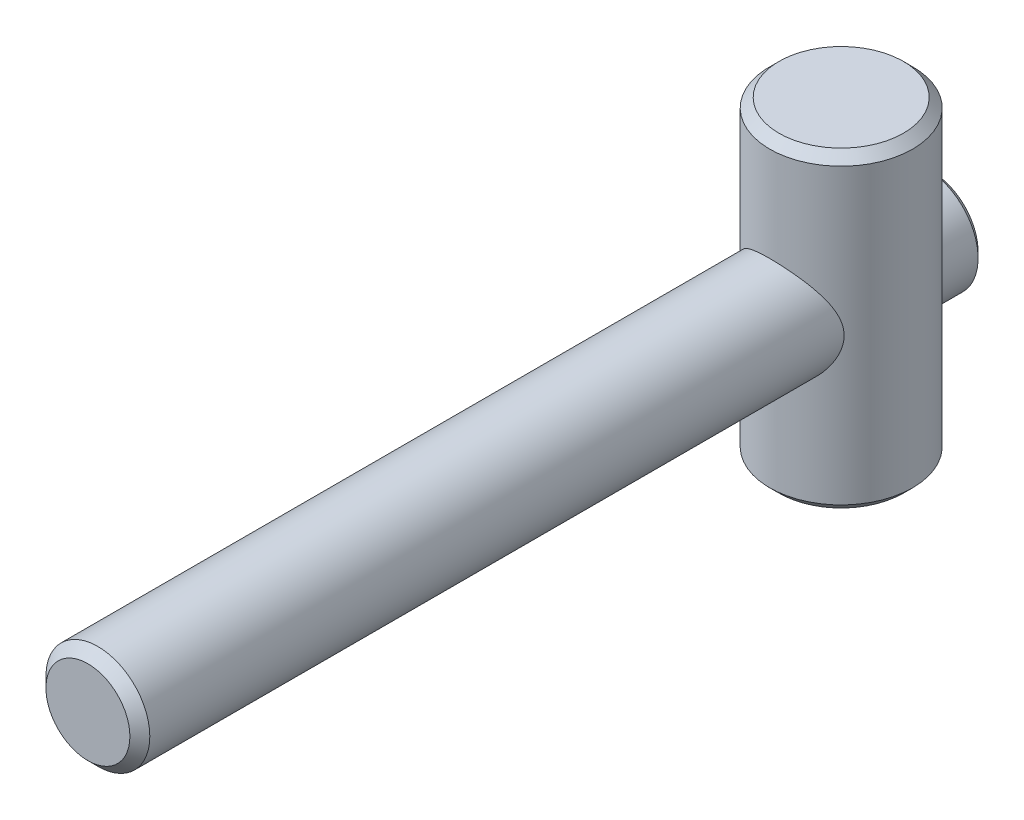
ISO-10303-21;
HEADER;
FILE_DESCRIPTION(('STEP AP214'),'2;1');
FILE_NAME('part.step','',(''),(''),'','','');
FILE_SCHEMA(('AUTOMOTIVE_DESIGN { 1 0 10303 214 1 1 1 1 }'));
ENDSEC;
DATA;
#1=APPLICATION_CONTEXT('core data for automotive mechanical design processes');
#2=APPLICATION_PROTOCOL_DEFINITION('international standard','automotive_design',2000,#1);
#3=PRODUCT_CONTEXT('',#1,'mechanical');
#4=PRODUCT('Part','Part','',(#3));
#5=PRODUCT_RELATED_PRODUCT_CATEGORY('part','',(#4));
#6=PRODUCT_DEFINITION_FORMATION('','',#4);
#7=PRODUCT_DEFINITION_CONTEXT('part definition',#1,'design');
#8=PRODUCT_DEFINITION('design','',#6,#7);
#9=PRODUCT_DEFINITION_SHAPE('','',#8);
#10=(LENGTH_UNIT() NAMED_UNIT(*) SI_UNIT(.MILLI.,.METRE.));
#11=(NAMED_UNIT(*) PLANE_ANGLE_UNIT() SI_UNIT($,.RADIAN.));
#12=(NAMED_UNIT(*) SI_UNIT($,.STERADIAN.) SOLID_ANGLE_UNIT());
#13=UNCERTAINTY_MEASURE_WITH_UNIT(LENGTH_MEASURE(1.E-05),#10,'distance_accuracy_value','');
#14=(GEOMETRIC_REPRESENTATION_CONTEXT(3) GLOBAL_UNCERTAINTY_ASSIGNED_CONTEXT((#13)) GLOBAL_UNIT_ASSIGNED_CONTEXT((#10,
#11,#12)) REPRESENTATION_CONTEXT('',''));
#15=CARTESIAN_POINT('',(0.,0.,0.));
#16=DIRECTION('',(0.,0.,1.));
#17=DIRECTION('',(1.,0.,0.));
#18=AXIS2_PLACEMENT_3D('',#15,#16,#17);
#19=CARTESIAN_POINT('',(0.,0.,-25.3));
#20=DIRECTION('',(0.,0.,1.));
#21=DIRECTION('',(1.,0.,0.));
#22=AXIS2_PLACEMENT_3D('',#19,#20,#21);
#23=PLANE('',#22);
#24=CARTESIAN_POINT('',(0.,0.,-25.3));
#25=DIRECTION('',(0.,0.,1.));
#26=DIRECTION('',(1.,0.,0.));
#27=AXIS2_PLACEMENT_3D('',#24,#25,#26);
#28=CIRCLE('',#27,3.54);
#29=CARTESIAN_POINT('',(-0.6,3.48878202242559,-25.3));
#30=VERTEX_POINT('',#29);
#31=CARTESIAN_POINT('',(-0.6,-3.48878202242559,-25.3));
#32=VERTEX_POINT('',#31);
#33=EDGE_CURVE('E239',#30,#32,#28,.T.);
#34=ORIENTED_EDGE('',*,*,#33,.F.);
#35=DIRECTION('',(0.,-1.,0.));
#36=VECTOR('',#35,1.);
#37=CARTESIAN_POINT('',(-0.6,0.,-25.3));
#38=LINE('',#37,#36);
#39=EDGE_CURVE('E228',#30,#32,#38,.T.);
#40=ORIENTED_EDGE('',*,*,#39,.T.);
#41=EDGE_LOOP('',(#34,#40));
#42=FACE_BOUND('',#41,.T.);
#43=ADVANCED_FACE('F14',(#42),#23,.F.);
#44=CARTESIAN_POINT('',(0.,0.,-25.3));
#45=DIRECTION('',(0.,0.,1.));
#46=DIRECTION('',(1.,0.,0.));
#47=AXIS2_PLACEMENT_3D('',#44,#45,#46);
#48=CONICAL_SURFACE('',#47,3.54,0.785398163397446);
#49=CARTESIAN_POINT('',(0.,0.,-24.84));
#50=DIRECTION('',(0.,0.,1.));
#51=DIRECTION('',(1.,0.,0.));
#52=AXIS2_PLACEMENT_3D('',#49,#50,#51);
#53=CIRCLE('',#52,4.);
#54=CARTESIAN_POINT('',(-0.6,3.95474398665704,-24.84));
#55=VERTEX_POINT('',#54);
#56=CARTESIAN_POINT('',(-0.6,-3.95474398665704,-24.84));
#57=VERTEX_POINT('',#56);
#58=EDGE_CURVE('E235',#55,#57,#53,.T.);
#59=ORIENTED_EDGE('',*,*,#58,.F.);
#60=CARTESIAN_POINT('',(-0.6,3.9554519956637,-24.8393));
#61=CARTESIAN_POINT('',(-0.6,3.83941046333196,-24.9540237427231));
#62=CARTESIAN_POINT('',(-0.6,3.72331727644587,-25.0686953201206));
#63=CARTESIAN_POINT('',(-0.6,3.49091447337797,-25.2979511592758));
#64=CARTESIAN_POINT('',(-0.6,3.37460477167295,-25.4125353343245));
#65=CARTESIAN_POINT('',(-0.6,3.14054409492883,-25.642725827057));
#66=CARTESIAN_POINT('',(-0.6,3.02279099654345,-25.7583299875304));
#67=CARTESIAN_POINT('',(-0.6,2.78706506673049,-25.9891808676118));
#68=CARTESIAN_POINT('',(-0.6,2.66909239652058,-26.1044277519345));
#69=CARTESIAN_POINT('',(-0.6,2.38769992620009,-26.3783597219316));
#70=CARTESIAN_POINT('',(-0.6,2.2240974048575,-26.536857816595));
#71=CARTESIAN_POINT('',(-0.6,1.97745696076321,-26.7736454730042));
#72=CARTESIAN_POINT('',(-0.6,1.89495476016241,-26.8524926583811));
#73=CARTESIAN_POINT('',(-0.6,1.72944434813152,-27.0096193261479));
#74=CARTESIAN_POINT('',(-0.6,1.64643625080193,-27.0878989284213));
#75=CARTESIAN_POINT('',(-0.6,1.48033289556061,-27.2429690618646));
#76=CARTESIAN_POINT('',(-0.6,1.39724415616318,-27.319766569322));
#77=CARTESIAN_POINT('',(-0.6,1.2297853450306,-27.4721053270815));
#78=CARTESIAN_POINT('',(-0.6,1.14541426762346,-27.5476454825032));
#79=CARTESIAN_POINT('',(-0.6,1.01743134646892,-27.6590099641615));
#80=CARTESIAN_POINT('',(-0.6,0.974611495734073,-27.6957423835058));
#81=CARTESIAN_POINT('',(-0.6,0.88825104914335,-27.7683476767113));
#82=CARTESIAN_POINT('',(-0.6,0.844710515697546,-27.8042206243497));
#83=CARTESIAN_POINT('',(-0.6,0.756681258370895,-27.8746657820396));
#84=CARTESIAN_POINT('',(-0.6,0.712193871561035,-27.9092396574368));
#85=CARTESIAN_POINT('',(-0.6,0.621791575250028,-27.9764590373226));
#86=CARTESIAN_POINT('',(-0.6,0.575877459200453,-28.0091055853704));
#87=CARTESIAN_POINT('',(-0.6,0.517059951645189,-28.0479937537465));
#88=CARTESIAN_POINT('',(-0.6,0.505142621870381,-28.0557273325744));
#89=CARTESIAN_POINT('',(-0.6,0.481156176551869,-28.0709583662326));
#90=CARTESIAN_POINT('',(-0.6,0.469087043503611,-28.0784557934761));
#91=CARTESIAN_POINT('',(-0.6,0.432629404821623,-28.1005451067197));
#92=CARTESIAN_POINT('',(-0.6,0.407992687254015,-28.1147326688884));
#93=CARTESIAN_POINT('',(-0.6,0.358127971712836,-28.1415606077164));
#94=CARTESIAN_POINT('',(-0.6,0.332906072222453,-28.1542121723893));
#95=CARTESIAN_POINT('',(-0.6,0.28159268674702,-28.1776006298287));
#96=CARTESIAN_POINT('',(-0.6,0.255501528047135,-28.1883382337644));
#97=CARTESIAN_POINT('',(-0.6,0.19385499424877,-28.2103112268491));
#98=CARTESIAN_POINT('',(-0.6,0.157946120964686,-28.2206034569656));
#99=CARTESIAN_POINT('',(-0.6,0.0849893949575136,-28.2350528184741));
#100=CARTESIAN_POINT('',(-0.6,0.0479465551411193,-28.2392338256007));
#101=CARTESIAN_POINT('',(-0.6,-0.0264554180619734,-28.2405737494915));
#102=CARTESIAN_POINT('',(-0.6,-0.0638152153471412,-28.237698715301));
#103=CARTESIAN_POINT('',(-0.6,-0.137530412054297,-28.2255268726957));
#104=CARTESIAN_POINT('',(-0.6,-0.173882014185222,-28.2162085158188));
#105=CARTESIAN_POINT('',(-0.6,-0.246261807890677,-28.1923675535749));
#106=CARTESIAN_POINT('',(-0.6,-0.282227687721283,-28.1776642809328));
#107=CARTESIAN_POINT('',(-0.6,-0.352560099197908,-28.1447807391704));
#108=CARTESIAN_POINT('',(-0.6,-0.386923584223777,-28.1265941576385));
#109=CARTESIAN_POINT('',(-0.6,-0.454569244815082,-28.0877625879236));
#110=CARTESIAN_POINT('',(-0.6,-0.487840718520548,-28.0670992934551));
#111=CARTESIAN_POINT('',(-0.6,-0.553299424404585,-28.024199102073));
#112=CARTESIAN_POINT('',(-0.6,-0.585487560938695,-28.0019635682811));
#113=CARTESIAN_POINT('',(-0.6,-0.651811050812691,-27.9544053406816));
#114=CARTESIAN_POINT('',(-0.6,-0.685873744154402,-27.928982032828));
#115=CARTESIAN_POINT('',(-0.6,-0.753285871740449,-27.8772035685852));
#116=CARTESIAN_POINT('',(-0.6,-0.786635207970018,-27.8508482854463));
#117=CARTESIAN_POINT('',(-0.6,-0.885905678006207,-27.7707557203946));
#118=CARTESIAN_POINT('',(-0.6,-0.951015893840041,-27.7160164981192));
#119=CARTESIAN_POINT('',(-0.6,-1.08003348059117,-27.6049240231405));
#120=CARTESIAN_POINT('',(-0.6,-1.14393845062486,-27.5485680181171));
#121=CARTESIAN_POINT('',(-0.6,-1.27086154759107,-27.4349047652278));
#122=CARTESIAN_POINT('',(-0.6,-1.3338799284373,-27.3775978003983));
#123=CARTESIAN_POINT('',(-0.6,-1.4591376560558,-27.2625095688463));
#124=CARTESIAN_POINT('',(-0.6,-1.52137875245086,-27.2047301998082));
#125=CARTESIAN_POINT('',(-0.6,-1.64544200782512,-27.0887149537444));
#126=CARTESIAN_POINT('',(-0.6,-1.70726413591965,-27.0304790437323));
#127=CARTESIAN_POINT('',(-0.6,-1.89214348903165,-26.8554033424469));
#128=CARTESIAN_POINT('',(-0.6,-2.01474045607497,-26.738078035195));
#129=CARTESIAN_POINT('',(-0.6,-2.28982158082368,-26.4732317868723));
#130=CARTESIAN_POINT('',(-0.6,-2.44210553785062,-26.3255035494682));
#131=CARTESIAN_POINT('',(-0.6,-2.74608630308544,-26.0293359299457));
#132=CARTESIAN_POINT('',(-0.6,-2.89778288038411,-25.8808963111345));
#133=CARTESIAN_POINT('',(-0.6,-3.20065551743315,-25.5837234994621));
#134=CARTESIAN_POINT('',(-0.6,-3.35183189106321,-25.4349906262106));
#135=CARTESIAN_POINT('',(-0.6,-3.653848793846,-25.1372979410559));
#136=CARTESIAN_POINT('',(-0.6,-3.80468942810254,-24.9883382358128));
#137=CARTESIAN_POINT('',(-0.6,-3.9554519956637,-24.8393));
#138=B_SPLINE_CURVE_WITH_KNOTS('',3,(#60,#61,#62,#63,#64,#65,#66,#67,#68,#69,#70,#71,#72,#73,
#74,#75,#76,#77,#78,#79,#80,#81,#82,#83,#84,#85,#86,#87,#88,#89,#90,#91,#92,#93,#94,#95,#96,#97,
#98,#99,#100,#101,#102,#103,#104,#105,#106,#107,#108,#109,#110,#111,#112,#113,#114,#115,#116,
#117,#118,#119,#120,#121,#122,#123,#124,#125,#126,#127,#128,#129,#130,#131,#132,#133,#134,#135,
#136,#137),.UNSPECIFIED.,.F.,.F.,(4,2,2,2,2,2,2,2,2,2,2,2,2,2,2,2,2,2,2,2,2,2,2,2,2,2,2,2,2,2,2,
2,2,2,2,2,2,2,4),(0.,0.489535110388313,0.979348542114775,1.47439453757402,1.96916156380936,
2.65251943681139,2.99487953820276,3.33716508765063,3.6765918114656,4.01630008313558,
4.18554223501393,4.35476980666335,4.5237724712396,4.69268277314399,4.73530049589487,
4.77792317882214,4.86317585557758,4.94776464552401,5.03232193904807,5.14397626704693,
5.25519319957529,5.36694631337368,5.47907498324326,5.5953739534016,5.71188570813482,
5.82931897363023,5.94665164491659,6.07414183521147,6.20164943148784,6.45678921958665,
6.71239265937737,6.96792134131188,7.22269628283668,7.47748980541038,7.98655823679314,
8.62305059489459,9.25977190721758,9.89599619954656,10.5319807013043),.UNSPECIFIED.);
#139=EDGE_CURVE('E221',#55,#30,#138,.T.);
#140=ORIENTED_EDGE('',*,*,#139,.T.);
#141=ORIENTED_EDGE('',*,*,#33,.T.);
#142=EDGE_CURVE('E229',#32,#57,#138,.T.);
#143=ORIENTED_EDGE('',*,*,#142,.T.);
#144=EDGE_LOOP('',(#59,#140,#141,#143));
#145=FACE_BOUND('',#144,.T.);
#146=ADVANCED_FACE('F215',(#145),#48,.T.);
#147=CARTESIAN_POINT('',(0.,0.,-12.8));
#148=DIRECTION('',(0.,0.,1.));
#149=DIRECTION('',(1.,0.,0.));
#150=AXIS2_PLACEMENT_3D('',#147,#148,#149);
#151=CYLINDRICAL_SURFACE('',#150,4.);
#152=CARTESIAN_POINT('',(4.,0.,-22.0749172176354));
#153=CARTESIAN_POINT('',(3.99999971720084,0.094559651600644,-22.0749177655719));
#154=CARTESIAN_POINT('',(3.99663873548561,0.189122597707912,-22.078488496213));
#155=CARTESIAN_POINT('',(3.98328406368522,0.377297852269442,-22.0925637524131));
#156=CARTESIAN_POINT('',(3.97328671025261,0.470909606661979,-22.1030721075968));
#157=CARTESIAN_POINT('',(3.94687649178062,0.65648336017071,-22.1304732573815));
#158=CARTESIAN_POINT('',(3.93044906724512,0.748441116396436,-22.1473805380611));
#159=CARTESIAN_POINT('',(3.89152450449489,0.929870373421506,-22.1867470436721));
#160=CARTESIAN_POINT('',(3.86902376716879,1.01934036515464,-22.2092095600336));
#161=CARTESIAN_POINT('',(3.79365509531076,1.28093397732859,-22.2828450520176));
#162=CARTESIAN_POINT('',(3.73252985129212,1.44885844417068,-22.3407009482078));
#163=CARTESIAN_POINT('',(3.590688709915,1.77146295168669,-22.4672506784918));
#164=CARTESIAN_POINT('',(3.50997431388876,1.92614400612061,-22.5359436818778));
#165=CARTESIAN_POINT('',(3.31318173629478,2.25065582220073,-22.6922095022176));
#166=CARTESIAN_POINT('',(3.19328494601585,2.41764951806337,-22.7808675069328));
#167=CARTESIAN_POINT('',(2.92908108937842,2.73178094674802,-22.9578760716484));
#168=CARTESIAN_POINT('',(2.78474090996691,2.87889125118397,-23.0462260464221));
#169=CARTESIAN_POINT('',(2.5362822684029,3.09553636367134,-23.1814353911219));
#170=CARTESIAN_POINT('',(2.43963284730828,3.17231415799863,-23.2305740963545));
#171=CARTESIAN_POINT('',(2.23844845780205,3.31733570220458,-23.3251054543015));
#172=CARTESIAN_POINT('',(2.13391712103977,3.38558334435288,-23.3704998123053));
#173=CARTESIAN_POINT('',(1.91752007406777,3.51266692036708,-23.4562228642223));
#174=CARTESIAN_POINT('',(1.80566515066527,3.57151627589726,-23.49655876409));
#175=CARTESIAN_POINT('',(1.57523382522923,3.67896799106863,-23.5709873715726));
#176=CARTESIAN_POINT('',(1.45666071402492,3.72757531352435,-23.6050831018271));
#177=CARTESIAN_POINT('',(1.16188171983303,3.83193503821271,-23.678830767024));
#178=CARTESIAN_POINT('',(0.982606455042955,3.88193864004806,-23.7146815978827));
#179=CARTESIAN_POINT('',(0.616370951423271,3.95663720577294,-23.7684829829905));
#180=CARTESIAN_POINT('',(0.429417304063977,3.98135342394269,-23.7864485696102));
#181=CARTESIAN_POINT('',(0.052567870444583,4.00411402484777,-23.8029868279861));
#182=CARTESIAN_POINT('',(-0.137333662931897,4.00209732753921,-23.8015150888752));
#183=CARTESIAN_POINT('',(-0.51380986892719,3.97135939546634,-23.7791958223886));
#184=CARTESIAN_POINT('',(-0.700383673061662,3.94263129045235,-23.7583433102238));
#185=CARTESIAN_POINT('',(-1.05962164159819,3.86136821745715,-23.699944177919));
#186=CARTESIAN_POINT('',(-1.23253206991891,3.80954610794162,-23.6628980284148));
#187=CARTESIAN_POINT('',(-1.56671343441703,3.68473335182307,-23.5749694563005));
#188=CARTESIAN_POINT('',(-1.72798199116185,3.61173839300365,-23.5240842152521));
#189=CARTESIAN_POINT('',(-2.05370310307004,3.43803005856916,-23.4054456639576));
#190=CARTESIAN_POINT('',(-2.2165364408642,3.33514439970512,-23.3364494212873));
#191=CARTESIAN_POINT('',(-2.52348319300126,3.10940476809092,-23.189889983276));
#192=CARTESIAN_POINT('',(-2.66757825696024,2.98653148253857,-23.1123185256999));
#193=CARTESIAN_POINT('',(-2.96150593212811,2.69807007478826,-22.9383041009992));
#194=CARTESIAN_POINT('',(-3.10726104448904,2.52879913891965,-22.8410685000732));
#195=CARTESIAN_POINT('',(-3.36953999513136,2.16705523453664,-22.6499971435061));
#196=CARTESIAN_POINT('',(-3.48605965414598,1.97457895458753,-22.556161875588));
#197=CARTESIAN_POINT('',(-3.66526169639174,1.61165125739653,-22.402032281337));
#198=CARTESIAN_POINT('',(-3.73414032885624,1.44549066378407,-22.3388789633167));
#199=CARTESIAN_POINT('',(-3.84985589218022,1.10068331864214,-22.2287430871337));
#200=CARTESIAN_POINT('',(-3.89674227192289,0.922065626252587,-22.1817243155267));
#201=CARTESIAN_POINT('',(-3.9599937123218,0.585461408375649,-22.1170906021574));
#202=CARTESIAN_POINT('',(-3.98009730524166,0.428880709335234,-22.0959235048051));
#203=CARTESIAN_POINT('',(-4.00152507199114,0.113064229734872,-22.0733369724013));
#204=CARTESIAN_POINT('',(-4.00286519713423,-0.0461691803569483,-22.0719007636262));
#205=CARTESIAN_POINT('',(-3.98669865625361,-0.362327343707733,-22.0889767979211));
#206=CARTESIAN_POINT('',(-3.96921589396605,-0.519254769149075,-22.1074637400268));
#207=CARTESIAN_POINT('',(-3.91666535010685,-0.82717652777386,-22.1614916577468));
#208=CARTESIAN_POINT('',(-3.88157034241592,-0.978161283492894,-22.1970590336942));
#209=CARTESIAN_POINT('',(-3.77812999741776,-1.33113055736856,-22.2978469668));
#210=CARTESIAN_POINT('',(-3.70207893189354,-1.52906623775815,-22.3692423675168));
#211=CARTESIAN_POINT('',(-3.52270580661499,-1.90640842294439,-22.5254840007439));
#212=CARTESIAN_POINT('',(-3.41932922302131,-2.08577687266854,-22.6103569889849));
#213=CARTESIAN_POINT('',(-3.18411833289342,-2.43025180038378,-22.7870574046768));
#214=CARTESIAN_POINT('',(-3.05152555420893,-2.59477148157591,-22.8790168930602));
#215=CARTESIAN_POINT('',(-2.76125147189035,-2.90173861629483,-23.059699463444));
#216=CARTESIAN_POINT('',(-2.6035911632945,-3.04420434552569,-23.1484251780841));
#217=CARTESIAN_POINT('',(-2.271539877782,-3.2987599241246,-23.3122631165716));
#218=CARTESIAN_POINT('',(-2.09818660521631,-3.41190835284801,-23.3878018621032));
#219=CARTESIAN_POINT('',(-1.82330793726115,-3.56180731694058,-23.4899086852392));
#220=CARTESIAN_POINT('',(-1.72916099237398,-3.6084863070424,-23.5220894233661));
#221=CARTESIAN_POINT('',(-1.53632285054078,-3.69470582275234,-23.5820343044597));
#222=CARTESIAN_POINT('',(-1.43763386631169,-3.73424977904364,-23.6098005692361));
#223=CARTESIAN_POINT('',(-1.23534308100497,-3.80598862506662,-23.6604944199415));
#224=CARTESIAN_POINT('',(-1.13170490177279,-3.83811376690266,-23.683375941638));
#225=CARTESIAN_POINT('',(-0.921160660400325,-3.89401032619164,-23.7233693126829));
#226=CARTESIAN_POINT('',(-0.81425636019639,-3.9177861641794,-23.7404842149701));
#227=CARTESIAN_POINT('',(-0.598125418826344,-3.95655048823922,-23.7684652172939));
#228=CARTESIAN_POINT('',(-0.488900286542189,-3.9715445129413,-23.7793352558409));
#229=CARTESIAN_POINT('',(-0.269138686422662,-3.9924605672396,-23.7945144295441));
#230=CARTESIAN_POINT('',(-0.15860243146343,-3.99838404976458,-23.7988246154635));
#231=CARTESIAN_POINT('',(0.0467313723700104,-4.00084937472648,-23.8006178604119));
#232=CARTESIAN_POINT('',(0.141509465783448,-3.99861635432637,-23.7989924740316));
#233=CARTESIAN_POINT('',(0.330490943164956,-3.98744748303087,-23.7908762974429));
#234=CARTESIAN_POINT('',(0.424694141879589,-3.97850957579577,-23.7843840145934));
#235=CARTESIAN_POINT('',(0.611759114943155,-3.95406659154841,-23.7666782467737));
#236=CARTESIAN_POINT('',(0.704621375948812,-3.93856396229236,-23.7554665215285));
#237=CARTESIAN_POINT('',(0.88841574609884,-3.90122128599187,-23.7285691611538));
#238=CARTESIAN_POINT('',(0.979347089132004,-3.87937877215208,-23.7128817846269));
#239=CARTESIAN_POINT('',(1.24445933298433,-3.80583624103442,-23.6603363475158));
#240=CARTESIAN_POINT('',(1.41518501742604,-3.74554675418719,-23.6175701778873));
#241=CARTESIAN_POINT('',(1.74369677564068,-3.60438289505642,-23.5191022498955));
#242=CARTESIAN_POINT('',(1.90148075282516,-3.5235051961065,-23.4633984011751));
#243=CARTESIAN_POINT('',(2.22228203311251,-3.33179335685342,-23.3343972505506));
#244=CARTESIAN_POINT('',(2.38322541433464,-3.21841054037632,-23.2597469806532));
#245=CARTESIAN_POINT('',(2.68497920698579,-2.97136345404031,-23.103106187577));
#246=CARTESIAN_POINT('',(2.82576198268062,-2.8376718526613,-23.0211058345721));
#247=CARTESIAN_POINT('',(3.03332548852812,-2.61000808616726,-22.8888332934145));
#248=CARTESIAN_POINT('',(3.10699576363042,-2.5218601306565,-22.839152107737));
#249=CARTESIAN_POINT('',(3.24665706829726,-2.3393224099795,-22.7403298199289));
#250=CARTESIAN_POINT('',(3.31264615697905,-2.24493107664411,-22.69118885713));
#251=CARTESIAN_POINT('',(3.43660180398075,-2.0501419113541,-22.5948719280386));
#252=CARTESIAN_POINT('',(3.49457298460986,-1.94974758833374,-22.5476948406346));
#253=CARTESIAN_POINT('',(3.6021255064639,-1.74306577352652,-22.4568795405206));
#254=CARTESIAN_POINT('',(3.6517073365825,-1.63677862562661,-22.4132411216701));
#255=CARTESIAN_POINT('',(3.76078752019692,-1.37275858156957,-22.3142162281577));
#256=CARTESIAN_POINT('',(3.81580236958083,-1.21205137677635,-22.2615166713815));
#257=CARTESIAN_POINT('',(3.88309107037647,-0.963817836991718,-22.1952018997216));
#258=CARTESIAN_POINT('',(3.90296834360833,-0.879972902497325,-22.1752342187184));
#259=CARTESIAN_POINT('',(3.93739985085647,-0.710192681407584,-22.1402454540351));
#260=CARTESIAN_POINT('',(3.95195647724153,-0.62425835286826,-22.1252221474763));
#261=CARTESIAN_POINT('',(3.97571410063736,-0.449073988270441,-22.1005263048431));
#262=CARTESIAN_POINT('',(3.98480070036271,-0.359792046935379,-22.0909682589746));
#263=CARTESIAN_POINT('',(3.99694447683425,-0.180341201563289,-22.0781627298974));
#264=CARTESIAN_POINT('',(4.00000026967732,-0.0901720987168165,-22.0749166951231));
#265=CARTESIAN_POINT('',(4.,0.,-22.0749172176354));
#266=B_SPLINE_CURVE_WITH_KNOTS('',3,(#152,#153,#154,#155,#156,#157,#158,#159,#160,#161,#162,
#163,#164,#165,#166,#167,#168,#169,#170,#171,#172,#173,#174,#175,#176,#177,#178,#179,#180,#181,
#182,#183,#184,#185,#186,#187,#188,#189,#190,#191,#192,#193,#194,#195,#196,#197,#198,#199,#200,
#201,#202,#203,#204,#205,#206,#207,#208,#209,#210,#211,#212,#213,#214,#215,#216,#217,#218,#219,
#220,#221,#222,#223,#224,#225,#226,#227,#228,#229,#230,#231,#232,#233,#234,#235,#236,#237,#238,
#239,#240,#241,#242,#243,#244,#245,#246,#247,#248,#249,#250,#251,#252,#253,#254,#255,#256,#257,
#258,#259,#260,#261,#262,#263,#264,#265),.UNSPECIFIED.,.T.,.F.,(4,2,2,2,2,2,2,2,2,2,2,2,2,2,2,2,
2,2,2,2,2,2,2,2,2,2,2,2,2,2,2,2,2,2,2,2,2,2,2,2,2,2,2,2,2,2,2,2,2,2,2,2,2,2,2,2,4),(0.,
0.283560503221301,0.567277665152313,0.851640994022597,1.13617321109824,1.69729774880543,
2.25837929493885,2.92774006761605,3.59801497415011,3.99610080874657,4.39400433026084,
4.79133442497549,5.18847154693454,5.75445889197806,6.31997012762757,6.88677367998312,
7.45372305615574,8.00426875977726,8.5549266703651,9.16646484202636,9.77859745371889,
10.5066073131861,11.2347211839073,11.8047550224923,12.3735009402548,12.8491941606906,
13.3244829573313,13.7991688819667,14.2745908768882,14.94214771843,15.6110467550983,
16.2999460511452,16.9882713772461,17.6463931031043,17.9757519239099,18.3049519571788,
18.6371312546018,18.9691344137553,19.3009279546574,19.6326683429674,19.9167672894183,
20.2009534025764,20.4850336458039,20.7692245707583,21.3249022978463,21.8806698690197,
22.5100347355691,23.1402542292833,23.5154020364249,23.8906444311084,24.2656695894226,
24.6406728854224,25.1720162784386,25.4371121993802,25.7020887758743,25.9724300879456,
26.24283342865),.UNSPECIFIED.);
#267=CARTESIAN_POINT('',(-0.6,3.95474398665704,-23.7671747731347));
#268=VERTEX_POINT('',#267);
#269=CARTESIAN_POINT('',(-0.6,-3.95474398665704,-23.7671747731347));
#270=VERTEX_POINT('',#269);
#271=EDGE_CURVE('E259',#268,#270,#266,.T.);
#272=ORIENTED_EDGE('',*,*,#271,.F.);
#273=DIRECTION('',(0.,0.,1.));
#274=VECTOR('',#273,1.);
#275=CARTESIAN_POINT('',(-0.6,3.95474398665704,-12.8));
#276=LINE('',#275,#274);
#277=EDGE_CURVE('E97',#268,#55,#276,.F.);
#278=ORIENTED_EDGE('',*,*,#277,.T.);
#279=ORIENTED_EDGE('',*,*,#58,.T.);
#280=DIRECTION('',(0.,0.,1.));
#281=VECTOR('',#280,1.);
#282=CARTESIAN_POINT('',(-0.6,-3.95474398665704,-12.8));
#283=LINE('',#282,#281);
#284=EDGE_CURVE('E244',#57,#270,#283,.T.);
#285=ORIENTED_EDGE('',*,*,#284,.T.);
#286=EDGE_LOOP('',(#272,#278,#279,#285));
#287=FACE_BOUND('',#286,.T.);
#288=ADVANCED_FACE('F196',(#287),#151,.T.);
#289=CARTESIAN_POINT('',(-0.6,0.,-54.8));
#290=DIRECTION('',(1.,0.,0.));
#291=DIRECTION('',(0.,-1.,0.));
#292=AXIS2_PLACEMENT_3D('',#289,#290,#291);
#293=CYLINDRICAL_SURFACE('',#292,31.5);
#294=CARTESIAN_POINT('',(0.7202,3.64052452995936,-23.5110789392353));
#295=CARTESIAN_POINT('',(0.629300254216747,3.66094254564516,-23.5134577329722));
#296=CARTESIAN_POINT('',(0.537517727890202,3.67749677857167,-23.515401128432));
#297=CARTESIAN_POINT('',(0.352855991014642,3.70277065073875,-23.5183807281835));
#298=CARTESIAN_POINT('',(0.259976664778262,3.71148945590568,-23.519416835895));
#299=CARTESIAN_POINT('',(0.0755266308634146,3.72089352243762,-23.5205345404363));
#300=CARTESIAN_POINT('',(-0.0160366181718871,3.7217239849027,-23.5206333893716));
#301=CARTESIAN_POINT('',(-0.198893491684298,3.71572448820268,-23.5199199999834));
#302=CARTESIAN_POINT('',(-0.290187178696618,3.70889647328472,-23.5191079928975));
#303=CARTESIAN_POINT('',(-0.438017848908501,3.69161294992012,-23.5170647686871));
#304=CARTESIAN_POINT('',(-0.494837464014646,3.68345523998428,-23.516102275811));
#305=CARTESIAN_POINT('',(-0.607946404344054,3.66419162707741,-23.5138403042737));
#306=CARTESIAN_POINT('',(-0.664235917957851,3.65308681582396,-23.5125409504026));
#307=CARTESIAN_POINT('',(-0.7202,3.64052452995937,-23.5110789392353));
#308=B_SPLINE_CURVE_WITH_KNOTS('',3,(#294,#295,#296,#297,#298,#299,#300,#301,#302,#303,#304,
#305,#306,#307),.UNSPECIFIED.,.F.,.F.,(4,2,2,2,2,2,4),(0.,0.279507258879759,0.559044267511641,
0.833425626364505,1.10773734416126,1.27989541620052,1.45198980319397),.UNSPECIFIED.);
#309=CARTESIAN_POINT('',(0.6,3.66517006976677,-23.5139563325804));
#310=VERTEX_POINT('',#309);
#311=CARTESIAN_POINT('',(-0.6,3.66517006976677,-23.5139563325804));
#312=VERTEX_POINT('',#311);
#313=EDGE_CURVE('E110',#310,#312,#308,.T.);
#314=ORIENTED_EDGE('',*,*,#313,.F.);
#315=CARTESIAN_POINT('',(0.6,0.,-54.8));
#316=DIRECTION('',(-1.,0.,0.));
#317=DIRECTION('',(0.,1.,0.));
#318=AXIS2_PLACEMENT_3D('',#315,#316,#317);
#319=CIRCLE('',#318,31.5);
#320=CARTESIAN_POINT('',(0.6,-3.66517006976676,-23.5139563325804));
#321=VERTEX_POINT('',#320);
#322=EDGE_CURVE('E119',#321,#310,#319,.T.);
#323=ORIENTED_EDGE('',*,*,#322,.F.);
#324=CARTESIAN_POINT('',(-0.7202,-3.64052452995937,-23.5110789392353));
#325=CARTESIAN_POINT('',(-0.629300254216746,-3.66094254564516,-23.5134577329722));
#326=CARTESIAN_POINT('',(-0.537517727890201,-3.67749677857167,-23.515401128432));
#327=CARTESIAN_POINT('',(-0.352855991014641,-3.70277065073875,-23.5183807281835));
#328=CARTESIAN_POINT('',(-0.259976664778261,-3.71148945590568,-23.519416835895));
#329=CARTESIAN_POINT('',(-0.0755266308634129,-3.72089352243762,-23.5205345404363));
#330=CARTESIAN_POINT('',(0.0160366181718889,-3.7217239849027,-23.5206333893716));
#331=CARTESIAN_POINT('',(0.1988934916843,-3.71572448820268,-23.5199199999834));
#332=CARTESIAN_POINT('',(0.29018717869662,-3.70889647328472,-23.5191079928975));
#333=CARTESIAN_POINT('',(0.438017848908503,-3.69161294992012,-23.5170647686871));
#334=CARTESIAN_POINT('',(0.494837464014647,-3.68345523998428,-23.516102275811));
#335=CARTESIAN_POINT('',(0.607946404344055,-3.66419162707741,-23.5138403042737));
#336=CARTESIAN_POINT('',(0.664235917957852,-3.65308681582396,-23.5125409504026));
#337=CARTESIAN_POINT('',(0.7202,-3.64052452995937,-23.5110789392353));
#338=B_SPLINE_CURVE_WITH_KNOTS('',3,(#324,#325,#326,#327,#328,#329,#330,#331,#332,#333,#334,
#335,#336,#337),.UNSPECIFIED.,.F.,.F.,(4,2,2,2,2,2,4),(0.,0.279507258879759,0.559044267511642,
0.833425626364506,1.10773734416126,1.27989541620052,1.45198980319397),.UNSPECIFIED.);
#339=CARTESIAN_POINT('',(-0.6,-3.66517006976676,-23.5139563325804));
#340=VERTEX_POINT('',#339);
#341=EDGE_CURVE('E102',#340,#321,#338,.T.);
#342=ORIENTED_EDGE('',*,*,#341,.F.);
#343=CARTESIAN_POINT('',(-0.6,0.,-54.8));
#344=DIRECTION('',(-1.,0.,0.));
#345=DIRECTION('',(0.,1.,0.));
#346=AXIS2_PLACEMENT_3D('',#343,#344,#345);
#347=CIRCLE('',#346,31.5);
#348=EDGE_CURVE('E19',#340,#312,#347,.T.);
#349=ORIENTED_EDGE('',*,*,#348,.T.);
#350=EDGE_LOOP('',(#314,#323,#342,#349));
#351=FACE_BOUND('',#350,.T.);
#352=ADVANCED_FACE('F191',(#351),#293,.F.);
#353=DIRECTION('',(0.,-1.,0.));
#354=VECTOR('',#353,1.);
#355=CARTESIAN_POINT('',(0.6,0.,-25.3));
#356=LINE('',#355,#354);
#357=CARTESIAN_POINT('',(0.6,3.48878202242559,-25.3));
#358=VERTEX_POINT('',#357);
#359=CARTESIAN_POINT('',(0.6,-3.48878202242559,-25.3));
#360=VERTEX_POINT('',#359);
#361=EDGE_CURVE('E212',#358,#360,#356,.T.);
#362=ORIENTED_EDGE('',*,*,#361,.F.);
#363=EDGE_CURVE('E236',#360,#358,#28,.T.);
#364=ORIENTED_EDGE('',*,*,#363,.F.);
#365=EDGE_LOOP('',(#362,#364));
#366=FACE_BOUND('',#365,.T.);
#367=ADVANCED_FACE('F195',(#366),#23,.F.);
#368=CARTESIAN_POINT('',(0.6,3.9554519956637,-24.8393));
#369=CARTESIAN_POINT('',(0.6,3.83941046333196,-24.9540237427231));
#370=CARTESIAN_POINT('',(0.6,3.72331727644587,-25.0686953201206));
#371=CARTESIAN_POINT('',(0.6,3.49091447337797,-25.2979511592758));
#372=CARTESIAN_POINT('',(0.6,3.37460477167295,-25.4125353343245));
#373=CARTESIAN_POINT('',(0.6,3.14054409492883,-25.642725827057));
#374=CARTESIAN_POINT('',(0.6,3.02279099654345,-25.7583299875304));
#375=CARTESIAN_POINT('',(0.6,2.78706506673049,-25.9891808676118));
#376=CARTESIAN_POINT('',(0.6,2.66909239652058,-26.1044277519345));
#377=CARTESIAN_POINT('',(0.6,2.38769992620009,-26.3783597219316));
#378=CARTESIAN_POINT('',(0.6,2.2240974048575,-26.536857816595));
#379=CARTESIAN_POINT('',(0.6,1.97745696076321,-26.7736454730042));
#380=CARTESIAN_POINT('',(0.6,1.89495476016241,-26.8524926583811));
#381=CARTESIAN_POINT('',(0.6,1.72944434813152,-27.0096193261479));
#382=CARTESIAN_POINT('',(0.6,1.64643625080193,-27.0878989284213));
#383=CARTESIAN_POINT('',(0.6,1.48033289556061,-27.2429690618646));
#384=CARTESIAN_POINT('',(0.6,1.39724415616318,-27.319766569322));
#385=CARTESIAN_POINT('',(0.6,1.2297853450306,-27.4721053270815));
#386=CARTESIAN_POINT('',(0.6,1.14541426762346,-27.5476454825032));
#387=CARTESIAN_POINT('',(0.6,1.01743134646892,-27.6590099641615));
#388=CARTESIAN_POINT('',(0.6,0.974611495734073,-27.6957423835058));
#389=CARTESIAN_POINT('',(0.6,0.88825104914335,-27.7683476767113));
#390=CARTESIAN_POINT('',(0.6,0.844710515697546,-27.8042206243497));
#391=CARTESIAN_POINT('',(0.6,0.756681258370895,-27.8746657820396));
#392=CARTESIAN_POINT('',(0.6,0.712193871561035,-27.9092396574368));
#393=CARTESIAN_POINT('',(0.6,0.621791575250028,-27.9764590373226));
#394=CARTESIAN_POINT('',(0.6,0.575877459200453,-28.0091055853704));
#395=CARTESIAN_POINT('',(0.6,0.517059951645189,-28.0479937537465));
#396=CARTESIAN_POINT('',(0.6,0.505142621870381,-28.0557273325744));
#397=CARTESIAN_POINT('',(0.6,0.481156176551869,-28.0709583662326));
#398=CARTESIAN_POINT('',(0.6,0.469087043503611,-28.0784557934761));
#399=CARTESIAN_POINT('',(0.6,0.432629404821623,-28.1005451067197));
#400=CARTESIAN_POINT('',(0.6,0.407992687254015,-28.1147326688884));
#401=CARTESIAN_POINT('',(0.6,0.358127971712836,-28.1415606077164));
#402=CARTESIAN_POINT('',(0.6,0.332906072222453,-28.1542121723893));
#403=CARTESIAN_POINT('',(0.6,0.28159268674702,-28.1776006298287));
#404=CARTESIAN_POINT('',(0.6,0.255501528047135,-28.1883382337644));
#405=CARTESIAN_POINT('',(0.6,0.19385499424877,-28.2103112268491));
#406=CARTESIAN_POINT('',(0.6,0.157946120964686,-28.2206034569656));
#407=CARTESIAN_POINT('',(0.6,0.0849893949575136,-28.2350528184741));
#408=CARTESIAN_POINT('',(0.6,0.0479465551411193,-28.2392338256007));
#409=CARTESIAN_POINT('',(0.6,-0.0264554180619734,-28.2405737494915));
#410=CARTESIAN_POINT('',(0.6,-0.0638152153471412,-28.237698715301));
#411=CARTESIAN_POINT('',(0.6,-0.137530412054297,-28.2255268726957));
#412=CARTESIAN_POINT('',(0.6,-0.173882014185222,-28.2162085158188));
#413=CARTESIAN_POINT('',(0.6,-0.246261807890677,-28.1923675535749));
#414=CARTESIAN_POINT('',(0.6,-0.282227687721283,-28.1776642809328));
#415=CARTESIAN_POINT('',(0.6,-0.352560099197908,-28.1447807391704));
#416=CARTESIAN_POINT('',(0.6,-0.386923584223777,-28.1265941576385));
#417=CARTESIAN_POINT('',(0.6,-0.454569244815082,-28.0877625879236));
#418=CARTESIAN_POINT('',(0.6,-0.487840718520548,-28.0670992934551));
#419=CARTESIAN_POINT('',(0.6,-0.553299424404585,-28.024199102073));
#420=CARTESIAN_POINT('',(0.6,-0.585487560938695,-28.0019635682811));
#421=CARTESIAN_POINT('',(0.6,-0.651811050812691,-27.9544053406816));
#422=CARTESIAN_POINT('',(0.6,-0.685873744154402,-27.928982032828));
#423=CARTESIAN_POINT('',(0.6,-0.753285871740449,-27.8772035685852));
#424=CARTESIAN_POINT('',(0.6,-0.786635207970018,-27.8508482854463));
#425=CARTESIAN_POINT('',(0.6,-0.885905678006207,-27.7707557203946));
#426=CARTESIAN_POINT('',(0.6,-0.951015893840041,-27.7160164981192));
#427=CARTESIAN_POINT('',(0.6,-1.08003348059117,-27.6049240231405));
#428=CARTESIAN_POINT('',(0.6,-1.14393845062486,-27.5485680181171));
#429=CARTESIAN_POINT('',(0.6,-1.27086154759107,-27.4349047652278));
#430=CARTESIAN_POINT('',(0.6,-1.3338799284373,-27.3775978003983));
#431=CARTESIAN_POINT('',(0.6,-1.4591376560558,-27.2625095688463));
#432=CARTESIAN_POINT('',(0.6,-1.52137875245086,-27.2047301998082));
#433=CARTESIAN_POINT('',(0.6,-1.64544200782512,-27.0887149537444));
#434=CARTESIAN_POINT('',(0.6,-1.70726413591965,-27.0304790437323));
#435=CARTESIAN_POINT('',(0.6,-1.89214348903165,-26.8554033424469));
#436=CARTESIAN_POINT('',(0.6,-2.01474045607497,-26.738078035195));
#437=CARTESIAN_POINT('',(0.6,-2.28982158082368,-26.4732317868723));
#438=CARTESIAN_POINT('',(0.6,-2.44210553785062,-26.3255035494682));
#439=CARTESIAN_POINT('',(0.6,-2.74608630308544,-26.0293359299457));
#440=CARTESIAN_POINT('',(0.6,-2.89778288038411,-25.8808963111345));
#441=CARTESIAN_POINT('',(0.6,-3.20065551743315,-25.5837234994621));
#442=CARTESIAN_POINT('',(0.6,-3.35183189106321,-25.4349906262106));
#443=CARTESIAN_POINT('',(0.6,-3.653848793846,-25.1372979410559));
#444=CARTESIAN_POINT('',(0.6,-3.80468942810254,-24.9883382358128));
#445=CARTESIAN_POINT('',(0.6,-3.9554519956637,-24.8393));
#446=B_SPLINE_CURVE_WITH_KNOTS('',3,(#368,#369,#370,#371,#372,#373,#374,#375,#376,#377,#378,
#379,#380,#381,#382,#383,#384,#385,#386,#387,#388,#389,#390,#391,#392,#393,#394,#395,#396,#397,
#398,#399,#400,#401,#402,#403,#404,#405,#406,#407,#408,#409,#410,#411,#412,#413,#414,#415,#416,
#417,#418,#419,#420,#421,#422,#423,#424,#425,#426,#427,#428,#429,#430,#431,#432,#433,#434,#435,
#436,#437,#438,#439,#440,#441,#442,#443,#444,#445),.UNSPECIFIED.,.F.,.F.,(4,2,2,2,2,2,2,2,2,2,2,
2,2,2,2,2,2,2,2,2,2,2,2,2,2,2,2,2,2,2,2,2,2,2,2,2,2,2,4),(0.,0.489535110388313,
0.979348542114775,1.47439453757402,1.96916156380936,2.65251943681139,2.99487953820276,
3.33716508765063,3.6765918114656,4.01630008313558,4.18554223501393,4.35476980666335,
4.5237724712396,4.69268277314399,4.73530049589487,4.77792317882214,4.86317585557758,
4.94776464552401,5.03232193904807,5.14397626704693,5.25519319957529,5.36694631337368,
5.47907498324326,5.5953739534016,5.71188570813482,5.82931897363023,5.94665164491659,
6.07414183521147,6.20164943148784,6.45678921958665,6.71239265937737,6.96792134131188,
7.22269628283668,7.47748980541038,7.98655823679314,8.62305059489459,9.25977190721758,
9.89599619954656,10.5319807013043),.UNSPECIFIED.);
#447=CARTESIAN_POINT('',(0.6,3.95474398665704,-24.84));
#448=VERTEX_POINT('',#447);
#449=EDGE_CURVE('E36',#448,#358,#446,.T.);
#450=ORIENTED_EDGE('',*,*,#449,.F.);
#451=CARTESIAN_POINT('',(0.6,-3.95474398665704,-24.84));
#452=VERTEX_POINT('',#451);
#453=EDGE_CURVE('E232',#452,#448,#53,.T.);
#454=ORIENTED_EDGE('',*,*,#453,.F.);
#455=EDGE_CURVE('E213',#360,#452,#446,.T.);
#456=ORIENTED_EDGE('',*,*,#455,.F.);
#457=ORIENTED_EDGE('',*,*,#363,.T.);
#458=EDGE_LOOP('',(#450,#454,#456,#457));
#459=FACE_BOUND('',#458,.T.);
#460=ADVANCED_FACE('F219',(#459),#48,.T.);
#461=CARTESIAN_POINT('',(0.6,-3.95474398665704,-23.7671747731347));
#462=VERTEX_POINT('',#461);
#463=CARTESIAN_POINT('',(0.6,3.95474398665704,-23.7671747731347));
#464=VERTEX_POINT('',#463);
#465=EDGE_CURVE('E263',#462,#464,#266,.T.);
#466=ORIENTED_EDGE('',*,*,#465,.F.);
#467=DIRECTION('',(0.,0.,1.));
#468=VECTOR('',#467,1.);
#469=CARTESIAN_POINT('',(0.6,-3.95474398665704,-12.8));
#470=LINE('',#469,#468);
#471=EDGE_CURVE('E242',#452,#462,#470,.T.);
#472=ORIENTED_EDGE('',*,*,#471,.F.);
#473=ORIENTED_EDGE('',*,*,#453,.T.);
#474=DIRECTION('',(0.,0.,1.));
#475=VECTOR('',#474,1.);
#476=CARTESIAN_POINT('',(0.6,3.95474398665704,-12.8));
#477=LINE('',#476,#475);
#478=EDGE_CURVE('E32',#464,#448,#477,.F.);
#479=ORIENTED_EDGE('',*,*,#478,.F.);
#480=EDGE_LOOP('',(#466,#472,#473,#479));
#481=FACE_BOUND('',#480,.T.);
#482=ADVANCED_FACE('F203',(#481),#151,.T.);
#483=CARTESIAN_POINT('',(0.6,0.,-54.8));
#484=DIRECTION('',(-1.,0.,0.));
#485=DIRECTION('',(0.,1.,0.));
#486=AXIS2_PLACEMENT_3D('',#483,#484,#485);
#487=PLANE('',#486);
#488=CARTESIAN_POINT('',(0.6,5.24144856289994,-25.0756784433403));
#489=CARTESIAN_POINT('',(0.6,4.98335054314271,-24.8193092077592));
#490=CARTESIAN_POINT('',(0.6,4.72517898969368,-24.5630130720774));
#491=CARTESIAN_POINT('',(0.6,4.20843297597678,-24.0508330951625));
#492=CARTESIAN_POINT('',(0.6,3.94985852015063,-23.7949492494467));
#493=CARTESIAN_POINT('',(0.6,3.56149681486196,-23.411626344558));
#494=CARTESIAN_POINT('',(0.6,3.43195870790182,-23.2839350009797));
#495=CARTESIAN_POINT('',(0.6,3.17264289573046,-23.0287963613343));
#496=CARTESIAN_POINT('',(0.6,3.04286519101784,-22.9013490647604));
#497=CARTESIAN_POINT('',(0.6,2.78297398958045,-22.6467936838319));
#498=CARTESIAN_POINT('',(0.6,2.65286048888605,-22.5196856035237));
#499=CARTESIAN_POINT('',(0.6,2.39209410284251,-22.2660223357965));
#500=CARTESIAN_POINT('',(0.6,2.26144121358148,-22.139467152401));
#501=CARTESIAN_POINT('',(0.6,2.13041700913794,-22.0132954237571));
#502=B_SPLINE_CURVE_WITH_KNOTS('',3,(#488,#489,#490,#491,#492,#493,#494,#495,#496,#497,#498,
#499,#500,#501),.UNSPECIFIED.,.F.,.F.,(4,2,2,2,2,2,4),(0.,1.09135708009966,2.18270221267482,
2.72838208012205,3.27406081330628,3.81974602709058,4.36543520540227),.UNSPECIFIED.);
#503=CARTESIAN_POINT('',(0.6,3.92153996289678,-23.7671747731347));
#504=VERTEX_POINT('',#503);
#505=EDGE_CURVE('E169',#504,#310,#502,.T.);
#506=ORIENTED_EDGE('',*,*,#505,.F.);
#507=DIRECTION('',(0.,1.,0.));
#508=VECTOR('',#507,1.);
#509=CARTESIAN_POINT('',(0.6,12.,-23.7671747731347));
#510=LINE('',#509,#508);
#511=EDGE_CURVE('E117',#504,#464,#510,.T.);
#512=ORIENTED_EDGE('',*,*,#511,.T.);
#513=ORIENTED_EDGE('',*,*,#478,.T.);
#514=ORIENTED_EDGE('',*,*,#449,.T.);
#515=ORIENTED_EDGE('',*,*,#361,.T.);
#516=ORIENTED_EDGE('',*,*,#455,.T.);
#517=ORIENTED_EDGE('',*,*,#471,.T.);
#518=CARTESIAN_POINT('',(0.6,-3.92153996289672,-23.7671747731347));
#519=VERTEX_POINT('',#518);
#520=EDGE_CURVE('E248',#462,#519,#510,.T.);
#521=ORIENTED_EDGE('',*,*,#520,.T.);
#522=CARTESIAN_POINT('',(0.6,-2.13041700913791,-22.0132954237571));
#523=CARTESIAN_POINT('',(0.6,-2.20825937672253,-22.088230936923));
#524=CARTESIAN_POINT('',(0.6,-2.2859592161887,-22.1633140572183));
#525=CARTESIAN_POINT('',(0.6,-2.44113254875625,-22.3137133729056));
#526=CARTESIAN_POINT('',(0.6,-2.51860604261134,-22.3890295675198));
#527=CARTESIAN_POINT('',(0.6,-2.75077459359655,-22.6152340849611));
#528=CARTESIAN_POINT('',(0.6,-2.90521897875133,-22.7663795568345));
#529=CARTESIAN_POINT('',(0.6,-3.21369228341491,-23.06908955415));
#530=CARTESIAN_POINT('',(0.6,-3.36772120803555,-23.2206540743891));
#531=CARTESIAN_POINT('',(0.6,-3.67550250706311,-23.524064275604));
#532=CARTESIAN_POINT('',(0.6,-3.82925488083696,-23.6759099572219));
#533=CARTESIAN_POINT('',(0.6,-4.19294614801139,-24.0355407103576));
#534=CARTESIAN_POINT('',(0.6,-4.40280249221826,-24.2434092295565));
#535=CARTESIAN_POINT('',(0.6,-4.82227635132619,-24.6593903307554));
#536=CARTESIAN_POINT('',(0.6,-5.03189386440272,-24.8675029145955));
#537=CARTESIAN_POINT('',(0.6,-5.24144856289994,-25.0756784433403));
#538=B_SPLINE_CURVE_WITH_KNOTS('',3,(#522,#523,#524,#525,#526,#527,#528,#529,#530,#531,#532,
#533,#534,#535,#536,#537),.UNSPECIFIED.,.F.,.F.,(4,2,2,2,2,2,2,4),(0.,0.324148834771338,
0.64829658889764,1.29658684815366,1.94486909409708,2.59315282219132,3.47929086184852,
4.36543562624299),.UNSPECIFIED.);
#539=EDGE_CURVE('E160',#321,#519,#538,.T.);
#540=ORIENTED_EDGE('',*,*,#539,.F.);
#541=ORIENTED_EDGE('',*,*,#322,.T.);
#542=EDGE_LOOP('',(#506,#512,#513,#514,#515,#516,#517,#521,#540,#541));
#543=FACE_BOUND('',#542,.T.);
#544=ADVANCED_FACE('F199',(#543),#487,.T.);
#545=CARTESIAN_POINT('',(-0.6,0.,-54.8));
#546=DIRECTION('',(-1.,0.,0.));
#547=DIRECTION('',(0.,1.,0.));
#548=AXIS2_PLACEMENT_3D('',#545,#546,#547);
#549=PLANE('',#548);
#550=DIRECTION('',(0.,1.,0.));
#551=VECTOR('',#550,1.);
#552=CARTESIAN_POINT('',(-0.6,12.,-23.7671747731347));
#553=LINE('',#552,#551);
#554=CARTESIAN_POINT('',(-0.6,3.92153996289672,-23.7671747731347));
#555=VERTEX_POINT('',#554);
#556=EDGE_CURVE('E91',#555,#268,#553,.T.);
#557=ORIENTED_EDGE('',*,*,#556,.F.);
#558=CARTESIAN_POINT('',(-0.6,5.24144856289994,-25.0756784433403));
#559=CARTESIAN_POINT('',(-0.6,4.98335054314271,-24.8193092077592));
#560=CARTESIAN_POINT('',(-0.6,4.72517898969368,-24.5630130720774));
#561=CARTESIAN_POINT('',(-0.6,4.20843297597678,-24.0508330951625));
#562=CARTESIAN_POINT('',(-0.6,3.94985852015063,-23.7949492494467));
#563=CARTESIAN_POINT('',(-0.6,3.56149681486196,-23.411626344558));
#564=CARTESIAN_POINT('',(-0.6,3.43195870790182,-23.2839350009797));
#565=CARTESIAN_POINT('',(-0.6,3.17264289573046,-23.0287963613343));
#566=CARTESIAN_POINT('',(-0.6,3.04286519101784,-22.9013490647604));
#567=CARTESIAN_POINT('',(-0.6,2.78297398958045,-22.6467936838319));
#568=CARTESIAN_POINT('',(-0.6,2.65286048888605,-22.5196856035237));
#569=CARTESIAN_POINT('',(-0.6,2.39209410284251,-22.2660223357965));
#570=CARTESIAN_POINT('',(-0.6,2.26144121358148,-22.1394671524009));
#571=CARTESIAN_POINT('',(-0.6,2.13041700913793,-22.0132954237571));
#572=B_SPLINE_CURVE_WITH_KNOTS('',3,(#558,#559,#560,#561,#562,#563,#564,#565,#566,#567,#568,
#569,#570,#571),.UNSPECIFIED.,.F.,.F.,(4,2,2,2,2,2,4),(0.,1.09135708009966,2.18270221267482,
2.72838208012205,3.27406081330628,3.81974602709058,4.36543520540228),.UNSPECIFIED.);
#573=EDGE_CURVE('E94',#555,#312,#572,.T.);
#574=ORIENTED_EDGE('',*,*,#573,.T.);
#575=ORIENTED_EDGE('',*,*,#348,.F.);
#576=CARTESIAN_POINT('',(-0.6,-2.13041700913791,-22.0132954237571));
#577=CARTESIAN_POINT('',(-0.6,-2.20825937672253,-22.088230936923));
#578=CARTESIAN_POINT('',(-0.6,-2.2859592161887,-22.1633140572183));
#579=CARTESIAN_POINT('',(-0.6,-2.44113254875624,-22.3137133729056));
#580=CARTESIAN_POINT('',(-0.6,-2.51860604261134,-22.3890295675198));
#581=CARTESIAN_POINT('',(-0.6,-2.75077459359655,-22.6152340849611));
#582=CARTESIAN_POINT('',(-0.6,-2.90521897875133,-22.7663795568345));
#583=CARTESIAN_POINT('',(-0.6,-3.21369228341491,-23.06908955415));
#584=CARTESIAN_POINT('',(-0.6,-3.36772120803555,-23.2206540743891));
#585=CARTESIAN_POINT('',(-0.6,-3.67550250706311,-23.524064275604));
#586=CARTESIAN_POINT('',(-0.6,-3.82925488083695,-23.6759099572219));
#587=CARTESIAN_POINT('',(-0.6,-4.19294614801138,-24.0355407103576));
#588=CARTESIAN_POINT('',(-0.6,-4.40280249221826,-24.2434092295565));
#589=CARTESIAN_POINT('',(-0.6,-4.82227635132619,-24.6593903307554));
#590=CARTESIAN_POINT('',(-0.6,-5.03189386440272,-24.8675029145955));
#591=CARTESIAN_POINT('',(-0.6,-5.24144856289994,-25.0756784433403));
#592=B_SPLINE_CURVE_WITH_KNOTS('',3,(#576,#577,#578,#579,#580,#581,#582,#583,#584,#585,#586,
#587,#588,#589,#590,#591),.UNSPECIFIED.,.F.,.F.,(4,2,2,2,2,2,2,4),(0.,0.324148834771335,
0.648296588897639,1.29658684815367,1.94486909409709,2.59315282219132,3.47929086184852,
4.36543562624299),.UNSPECIFIED.);
#593=CARTESIAN_POINT('',(-0.6,-3.92153996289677,-23.7671747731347));
#594=VERTEX_POINT('',#593);
#595=EDGE_CURVE('E175',#340,#594,#592,.T.);
#596=ORIENTED_EDGE('',*,*,#595,.T.);
#597=EDGE_CURVE('E104',#270,#594,#553,.T.);
#598=ORIENTED_EDGE('',*,*,#597,.F.);
#599=ORIENTED_EDGE('',*,*,#284,.F.);
#600=ORIENTED_EDGE('',*,*,#142,.F.);
#601=ORIENTED_EDGE('',*,*,#39,.F.);
#602=ORIENTED_EDGE('',*,*,#139,.F.);
#603=ORIENTED_EDGE('',*,*,#277,.F.);
#604=EDGE_LOOP('',(#557,#574,#575,#596,#598,#599,#600,#601,#602,#603));
#605=FACE_BOUND('',#604,.T.);
#606=ADVANCED_FACE('F16',(#605),#549,.F.);
#607=CARTESIAN_POINT('',(4.,0.,-14.5250827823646));
#608=CARTESIAN_POINT('',(3.99999971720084,-0.0945596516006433,-14.5250822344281));
#609=CARTESIAN_POINT('',(3.99663873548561,-0.189122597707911,-14.521511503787));
#610=CARTESIAN_POINT('',(3.98328406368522,-0.37729785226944,-14.5074362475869));
#611=CARTESIAN_POINT('',(3.97328671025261,-0.470909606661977,-14.4969278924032));
#612=CARTESIAN_POINT('',(3.94687649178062,-0.65648336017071,-14.4695267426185));
#613=CARTESIAN_POINT('',(3.93044906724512,-0.748441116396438,-14.4526194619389));
#614=CARTESIAN_POINT('',(3.89152450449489,-0.929870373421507,-14.4132529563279));
#615=CARTESIAN_POINT('',(3.86902376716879,-1.01934036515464,-14.3907904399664));
#616=CARTESIAN_POINT('',(3.79365509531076,-1.28093397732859,-14.3171549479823));
#617=CARTESIAN_POINT('',(3.73252985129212,-1.44885844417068,-14.2592990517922));
#618=CARTESIAN_POINT('',(3.590688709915,-1.7714629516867,-14.1327493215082));
#619=CARTESIAN_POINT('',(3.50997431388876,-1.92614400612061,-14.0640563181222));
#620=CARTESIAN_POINT('',(3.31318173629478,-2.25065582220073,-13.9077904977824));
#621=CARTESIAN_POINT('',(3.19328494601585,-2.41764951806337,-13.8191324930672));
#622=CARTESIAN_POINT('',(2.92908108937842,-2.73178094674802,-13.6421239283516));
#623=CARTESIAN_POINT('',(2.78474090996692,-2.87889125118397,-13.5537739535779));
#624=CARTESIAN_POINT('',(2.53628226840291,-3.09553636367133,-13.4185646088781));
#625=CARTESIAN_POINT('',(2.43963284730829,-3.17231415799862,-13.3694259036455));
#626=CARTESIAN_POINT('',(2.23844845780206,-3.31733570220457,-13.2748945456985));
#627=CARTESIAN_POINT('',(2.13391712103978,-3.38558334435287,-13.2295001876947));
#628=CARTESIAN_POINT('',(1.91752007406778,-3.51266692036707,-13.1437771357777));
#629=CARTESIAN_POINT('',(1.80566515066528,-3.57151627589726,-13.10344123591));
#630=CARTESIAN_POINT('',(1.57523382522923,-3.67896799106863,-13.0290126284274));
#631=CARTESIAN_POINT('',(1.45666071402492,-3.72757531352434,-12.9949168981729));
#632=CARTESIAN_POINT('',(1.16188171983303,-3.83193503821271,-12.921169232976));
#633=CARTESIAN_POINT('',(0.982606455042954,-3.88193864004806,-12.8853184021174));
#634=CARTESIAN_POINT('',(0.616370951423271,-3.95663720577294,-12.8315170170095));
#635=CARTESIAN_POINT('',(0.429417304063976,-3.98135342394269,-12.8135514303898));
#636=CARTESIAN_POINT('',(0.0525678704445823,-4.00411402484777,-12.7970131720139));
#637=CARTESIAN_POINT('',(-0.137333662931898,-4.00209732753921,-12.7984849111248));
#638=CARTESIAN_POINT('',(-0.51380986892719,-3.97135939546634,-12.8208041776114));
#639=CARTESIAN_POINT('',(-0.700383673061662,-3.94263129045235,-12.8416566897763));
#640=CARTESIAN_POINT('',(-1.05962164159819,-3.86136821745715,-12.900055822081));
#641=CARTESIAN_POINT('',(-1.23253206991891,-3.80954610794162,-12.9371019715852));
#642=CARTESIAN_POINT('',(-1.56671343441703,-3.68473335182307,-13.0250305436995));
#643=CARTESIAN_POINT('',(-1.72798199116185,-3.61173839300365,-13.0759157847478));
#644=CARTESIAN_POINT('',(-2.05370310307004,-3.43803005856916,-13.1945543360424));
#645=CARTESIAN_POINT('',(-2.2165364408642,-3.33514439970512,-13.2635505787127));
#646=CARTESIAN_POINT('',(-2.52348319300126,-3.10940476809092,-13.410110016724));
#647=CARTESIAN_POINT('',(-2.66757825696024,-2.98653148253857,-13.4876814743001));
#648=CARTESIAN_POINT('',(-2.96150593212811,-2.69807007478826,-13.6616958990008));
#649=CARTESIAN_POINT('',(-3.10726104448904,-2.52879913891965,-13.7589314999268));
#650=CARTESIAN_POINT('',(-3.36953999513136,-2.16705523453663,-13.9500028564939));
#651=CARTESIAN_POINT('',(-3.48605965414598,-1.97457895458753,-14.043838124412));
#652=CARTESIAN_POINT('',(-3.66526169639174,-1.61165125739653,-14.197967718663));
#653=CARTESIAN_POINT('',(-3.73414032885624,-1.44549066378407,-14.2611210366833));
#654=CARTESIAN_POINT('',(-3.84985589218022,-1.10068331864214,-14.3712569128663));
#655=CARTESIAN_POINT('',(-3.8967422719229,-0.922065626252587,-14.4182756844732));
#656=CARTESIAN_POINT('',(-3.95999371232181,-0.585461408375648,-14.4829093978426));
#657=CARTESIAN_POINT('',(-3.98009730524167,-0.428880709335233,-14.5040764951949));
#658=CARTESIAN_POINT('',(-4.00152507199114,-0.113064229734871,-14.5266630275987));
#659=CARTESIAN_POINT('',(-4.00286519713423,0.0461691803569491,-14.5280992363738));
#660=CARTESIAN_POINT('',(-3.98669865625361,0.362327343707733,-14.5110232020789));
#661=CARTESIAN_POINT('',(-3.96921589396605,0.519254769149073,-14.4925362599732));
#662=CARTESIAN_POINT('',(-3.91666535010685,0.827176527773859,-14.4385083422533));
#663=CARTESIAN_POINT('',(-3.88157034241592,0.978161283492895,-14.4029409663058));
#664=CARTESIAN_POINT('',(-3.77812999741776,1.33113055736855,-14.3021530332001));
#665=CARTESIAN_POINT('',(-3.70207893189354,1.52906623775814,-14.2307576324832));
#666=CARTESIAN_POINT('',(-3.522705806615,1.90640842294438,-14.0745159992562));
#667=CARTESIAN_POINT('',(-3.41932922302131,2.08577687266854,-13.9896430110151));
#668=CARTESIAN_POINT('',(-3.18411833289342,2.43025180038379,-13.8129425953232));
#669=CARTESIAN_POINT('',(-3.05152555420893,2.59477148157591,-13.7209831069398));
#670=CARTESIAN_POINT('',(-2.76125147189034,2.90173861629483,-13.540300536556));
#671=CARTESIAN_POINT('',(-2.6035911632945,3.04420434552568,-13.4515748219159));
#672=CARTESIAN_POINT('',(-2.271539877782,3.2987599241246,-13.2877368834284));
#673=CARTESIAN_POINT('',(-2.09818660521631,3.41190835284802,-13.2121981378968));
#674=CARTESIAN_POINT('',(-1.82330793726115,3.56180731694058,-13.1100913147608));
#675=CARTESIAN_POINT('',(-1.72916099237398,3.6084863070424,-13.0779105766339));
#676=CARTESIAN_POINT('',(-1.53632285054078,3.69470582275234,-13.0179656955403));
#677=CARTESIAN_POINT('',(-1.43763386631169,3.73424977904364,-12.990199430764));
#678=CARTESIAN_POINT('',(-1.23534308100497,3.80598862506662,-12.9395055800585));
#679=CARTESIAN_POINT('',(-1.13170490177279,3.83811376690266,-12.916624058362));
#680=CARTESIAN_POINT('',(-0.921160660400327,3.89401032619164,-12.8766306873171));
#681=CARTESIAN_POINT('',(-0.814256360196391,3.9177861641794,-12.8595157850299));
#682=CARTESIAN_POINT('',(-0.598125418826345,3.95655048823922,-12.8315347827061));
#683=CARTESIAN_POINT('',(-0.488900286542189,3.9715445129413,-12.8206647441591));
#684=CARTESIAN_POINT('',(-0.269138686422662,3.9924605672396,-12.8054855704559));
#685=CARTESIAN_POINT('',(-0.158602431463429,3.99838404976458,-12.8011753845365));
#686=CARTESIAN_POINT('',(0.046731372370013,4.00084937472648,-12.7993821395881));
#687=CARTESIAN_POINT('',(0.141509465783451,3.99861635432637,-12.8010075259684));
#688=CARTESIAN_POINT('',(0.330490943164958,3.98744748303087,-12.8091237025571));
#689=CARTESIAN_POINT('',(0.424694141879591,3.97850957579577,-12.8156159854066));
#690=CARTESIAN_POINT('',(0.611759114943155,3.95406659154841,-12.8333217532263));
#691=CARTESIAN_POINT('',(0.704621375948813,3.93856396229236,-12.8445334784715));
#692=CARTESIAN_POINT('',(0.88841574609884,3.90122128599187,-12.8714308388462));
#693=CARTESIAN_POINT('',(0.979347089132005,3.87937877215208,-12.8871182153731));
#694=CARTESIAN_POINT('',(1.24445933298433,3.80583624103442,-12.9396636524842));
#695=CARTESIAN_POINT('',(1.41518501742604,3.74554675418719,-12.9824298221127));
#696=CARTESIAN_POINT('',(1.74369677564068,3.60438289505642,-13.0808977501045));
#697=CARTESIAN_POINT('',(1.90148075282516,3.5235051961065,-13.1366015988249));
#698=CARTESIAN_POINT('',(2.22228203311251,3.33179335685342,-13.2656027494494));
#699=CARTESIAN_POINT('',(2.38322541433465,3.21841054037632,-13.3402530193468));
#700=CARTESIAN_POINT('',(2.68497920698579,2.97136345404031,-13.496893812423));
#701=CARTESIAN_POINT('',(2.82576198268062,2.8376718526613,-13.5788941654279));
#702=CARTESIAN_POINT('',(3.03332548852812,2.61000808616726,-13.7111667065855));
#703=CARTESIAN_POINT('',(3.10699576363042,2.5218601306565,-13.760847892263));
#704=CARTESIAN_POINT('',(3.24665706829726,2.33932240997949,-13.8596701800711));
#705=CARTESIAN_POINT('',(3.31264615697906,2.24493107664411,-13.9088111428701));
#706=CARTESIAN_POINT('',(3.43660180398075,2.05014191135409,-14.0051280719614));
#707=CARTESIAN_POINT('',(3.49457298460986,1.94974758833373,-14.0523051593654));
#708=CARTESIAN_POINT('',(3.60212550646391,1.74306577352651,-14.1431204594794));
#709=CARTESIAN_POINT('',(3.65170733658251,1.6367786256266,-14.18675887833));
#710=CARTESIAN_POINT('',(3.76078752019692,1.37275858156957,-14.2857837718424));
#711=CARTESIAN_POINT('',(3.81580236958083,1.21205137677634,-14.3384833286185));
#712=CARTESIAN_POINT('',(3.88309107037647,0.963817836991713,-14.4047981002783));
#713=CARTESIAN_POINT('',(3.90296834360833,0.879972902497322,-14.4247657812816));
#714=CARTESIAN_POINT('',(3.93739985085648,0.71019268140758,-14.4597545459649));
#715=CARTESIAN_POINT('',(3.95195647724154,0.624258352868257,-14.4747778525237));
#716=CARTESIAN_POINT('',(3.97571410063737,0.449073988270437,-14.4994736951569));
#717=CARTESIAN_POINT('',(3.98480070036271,0.359792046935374,-14.5090317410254));
#718=CARTESIAN_POINT('',(3.99694447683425,0.180341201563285,-14.5218372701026));
#719=CARTESIAN_POINT('',(4.00000026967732,0.0901720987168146,-14.525083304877));
#720=CARTESIAN_POINT('',(4.,0.,-14.5250827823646));
#721=B_SPLINE_CURVE_WITH_KNOTS('',3,(#607,#608,#609,#610,#611,#612,#613,#614,#615,#616,#617,
#618,#619,#620,#621,#622,#623,#624,#625,#626,#627,#628,#629,#630,#631,#632,#633,#634,#635,#636,
#637,#638,#639,#640,#641,#642,#643,#644,#645,#646,#647,#648,#649,#650,#651,#652,#653,#654,#655,
#656,#657,#658,#659,#660,#661,#662,#663,#664,#665,#666,#667,#668,#669,#670,#671,#672,#673,#674,
#675,#676,#677,#678,#679,#680,#681,#682,#683,#684,#685,#686,#687,#688,#689,#690,#691,#692,#693,
#694,#695,#696,#697,#698,#699,#700,#701,#702,#703,#704,#705,#706,#707,#708,#709,#710,#711,#712,
#713,#714,#715,#716,#717,#718,#719,#720),.UNSPECIFIED.,.T.,.F.,(4,2,2,2,2,2,2,2,2,2,2,2,2,2,2,2,
2,2,2,2,2,2,2,2,2,2,2,2,2,2,2,2,2,2,2,2,2,2,2,2,2,2,2,2,2,2,2,2,2,2,2,2,2,2,2,2,4),(0.,
0.2835605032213,0.567277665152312,0.851640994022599,1.13617321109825,1.69729774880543,
2.25837929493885,2.92774006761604,3.59801497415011,3.99610080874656,4.39400433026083,
4.79133442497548,5.18847154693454,5.75445889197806,6.31997012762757,6.88677367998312,
7.45372305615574,8.00426875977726,8.5549266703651,9.16646484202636,9.77859745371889,
10.5066073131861,11.2347211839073,11.8047550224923,12.3735009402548,12.8491941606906,
13.3244829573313,13.7991688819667,14.2745908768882,14.94214771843,15.6110467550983,
16.2999460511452,16.9882713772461,17.6463931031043,17.9757519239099,18.3049519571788,
18.6371312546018,18.9691344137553,19.3009279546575,19.6326683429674,19.9167672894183,
20.2009534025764,20.4850336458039,20.7692245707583,21.3249022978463,21.8806698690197,
22.5100347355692,23.1402542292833,23.5154020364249,23.8906444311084,24.2656695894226,
24.6406728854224,25.1720162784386,25.4371121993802,25.7020887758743,25.9724300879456,
26.24283342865),.UNSPECIFIED.);
#722=CARTESIAN_POINT('',(4.,0.,-14.5250827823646));
#723=VERTEX_POINT('',#722);
#724=EDGE_CURVE('E185',#723,#723,#721,.T.);
#725=ORIENTED_EDGE('',*,*,#724,.F.);
#726=EDGE_LOOP('',(#725));
#727=FACE_BOUND('',#726,.T.);
#728=CARTESIAN_POINT('',(0.,0.,38.933));
#729=DIRECTION('',(0.,0.,1.));
#730=DIRECTION('',(1.,0.,0.));
#731=AXIS2_PLACEMENT_3D('',#728,#729,#730);
#732=CIRCLE('',#731,4.);
#733=CARTESIAN_POINT('',(4.,0.,38.933));
#734=VERTEX_POINT('',#733);
#735=EDGE_CURVE('E264',#734,#734,#732,.T.);
#736=ORIENTED_EDGE('',*,*,#735,.F.);
#737=EDGE_LOOP('',(#736));
#738=FACE_BOUND('',#737,.T.);
#739=ADVANCED_FACE('F277',(#727,#738),#151,.T.);
#740=CARTESIAN_POINT('',(0.,-12.,-18.3));
#741=DIRECTION('',(0.,1.,0.));
#742=DIRECTION('',(1.,0.,0.));
#743=AXIS2_PLACEMENT_3D('',#740,#741,#742);
#744=PLANE('',#743);
#745=CARTESIAN_POINT('',(0.,-12.,-18.3));
#746=DIRECTION('',(0.,1.,0.));
#747=DIRECTION('',(1.,0.,0.));
#748=AXIS2_PLACEMENT_3D('',#745,#746,#747);
#749=CIRCLE('',#748,4.79289321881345);
#750=CARTESIAN_POINT('',(4.79289321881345,-12.,-18.3));
#751=VERTEX_POINT('',#750);
#752=EDGE_CURVE('E122',#751,#751,#749,.T.);
#753=ORIENTED_EDGE('',*,*,#752,.F.);
#754=EDGE_LOOP('',(#753));
#755=FACE_BOUND('',#754,.T.);
#756=ADVANCED_FACE('F286',(#755),#744,.F.);
#757=CARTESIAN_POINT('',(0.,12.,-23.0928932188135));
#758=DIRECTION('',(0.,-1.,0.));
#759=DIRECTION('',(-1.,0.,0.));
#760=AXIS2_PLACEMENT_3D('',#757,#758,#759);
#761=PLANE('',#760);
#762=CARTESIAN_POINT('',(0.,12.,-18.3));
#763=DIRECTION('',(0.,1.,0.));
#764=DIRECTION('',(1.,0.,0.));
#765=AXIS2_PLACEMENT_3D('',#762,#763,#764);
#766=CIRCLE('',#765,4.79289321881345);
#767=CARTESIAN_POINT('',(4.79289321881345,12.,-18.3));
#768=VERTEX_POINT('',#767);
#769=EDGE_CURVE('E9',#768,#768,#766,.T.);
#770=ORIENTED_EDGE('',*,*,#769,.T.);
#771=EDGE_LOOP('',(#770));
#772=FACE_BOUND('',#771,.T.);
#773=ADVANCED_FACE('F152',(#772),#761,.F.);
#774=CARTESIAN_POINT('',(0.,-12.,-18.3));
#775=DIRECTION('',(0.,1.,0.));
#776=DIRECTION('',(1.,0.,0.));
#777=AXIS2_PLACEMENT_3D('',#774,#775,#776);
#778=CONICAL_SURFACE('',#777,4.79289321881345,0.78539816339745);
#779=CARTESIAN_POINT('',(0.,-11.2928932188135,-18.3));
#780=DIRECTION('',(0.,1.,0.));
#781=DIRECTION('',(1.,0.,0.));
#782=AXIS2_PLACEMENT_3D('',#779,#780,#781);
#783=CIRCLE('',#782,5.5);
#784=CARTESIAN_POINT('',(5.5,-11.2928932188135,-18.3));
#785=VERTEX_POINT('',#784);
#786=EDGE_CURVE('E308',#785,#785,#783,.T.);
#787=ORIENTED_EDGE('',*,*,#786,.F.);
#788=EDGE_LOOP('',(#787));
#789=FACE_BOUND('',#788,.T.);
#790=ORIENTED_EDGE('',*,*,#752,.T.);
#791=EDGE_LOOP('',(#790));
#792=FACE_BOUND('',#791,.T.);
#793=ADVANCED_FACE('F294',(#789,#792),#778,.T.);
#794=CARTESIAN_POINT('',(0.,11.2928932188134,-18.3));
#795=DIRECTION('',(0.,-1.,0.));
#796=DIRECTION('',(-1.,0.,0.));
#797=AXIS2_PLACEMENT_3D('',#794,#795,#796);
#798=CONICAL_SURFACE('',#797,5.5,0.785398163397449);
#799=ORIENTED_EDGE('',*,*,#769,.F.);
#800=EDGE_LOOP('',(#799));
#801=FACE_BOUND('',#800,.T.);
#802=CARTESIAN_POINT('',(0.,11.2928932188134,-18.3));
#803=DIRECTION('',(0.,1.,0.));
#804=DIRECTION('',(1.,0.,0.));
#805=AXIS2_PLACEMENT_3D('',#802,#803,#804);
#806=CIRCLE('',#805,5.5);
#807=CARTESIAN_POINT('',(5.5,11.2928932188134,-18.3));
#808=VERTEX_POINT('',#807);
#809=EDGE_CURVE('E24',#808,#808,#806,.T.);
#810=ORIENTED_EDGE('',*,*,#809,.T.);
#811=EDGE_LOOP('',(#810));
#812=FACE_BOUND('',#811,.T.);
#813=ADVANCED_FACE('F298',(#801,#812),#798,.T.);
#814=CARTESIAN_POINT('',(0.,12.,-18.3));
#815=DIRECTION('',(0.,1.,0.));
#816=DIRECTION('',(1.,0.,0.));
#817=AXIS2_PLACEMENT_3D('',#814,#815,#816);
#818=CYLINDRICAL_SURFACE('',#817,5.5);
#819=ORIENTED_EDGE('',*,*,#809,.F.);
#820=EDGE_LOOP('',(#819));
#821=FACE_BOUND('',#820,.T.);
#822=ORIENTED_EDGE('',*,*,#786,.T.);
#823=EDGE_LOOP('',(#822));
#824=FACE_BOUND('',#823,.T.);
#825=ORIENTED_EDGE('',*,*,#271,.T.);
#826=ORIENTED_EDGE('',*,*,#597,.T.);
#827=CARTESIAN_POINT('',(2.17144416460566,-2.81248297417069,-23.3532));
#828=CARTESIAN_POINT('',(2.0690833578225,-2.94700705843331,-23.3971442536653));
#829=CARTESIAN_POINT('',(1.95731490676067,-3.07515187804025,-23.4415267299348));
#830=CARTESIAN_POINT('',(1.7139524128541,-3.31452488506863,-23.5277451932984));
#831=CARTESIAN_POINT('',(1.58217918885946,-3.42557978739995,-23.5695528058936));
#832=CARTESIAN_POINT('',(1.32837400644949,-3.6037499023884,-23.6384435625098));
#833=CARTESIAN_POINT('',(1.20977987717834,-3.67520879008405,-23.6667936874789));
#834=CARTESIAN_POINT('',(0.962048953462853,-3.79911511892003,-23.716673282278));
#835=CARTESIAN_POINT('',(0.832947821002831,-3.85162383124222,-23.7382247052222));
#836=CARTESIAN_POINT('',(0.565167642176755,-3.93463497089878,-23.7725623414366));
#837=CARTESIAN_POINT('',(0.426406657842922,-3.96491514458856,-23.7852599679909));
#838=CARTESIAN_POINT('',(0.145054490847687,-3.99975612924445,-23.7998860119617));
#839=CARTESIAN_POINT('',(0.00246399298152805,-4.00432150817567,-23.8018163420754));
#840=CARTESIAN_POINT('',(-0.262063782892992,-3.98843613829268,-23.7951349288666));
#841=CARTESIAN_POINT('',(-0.384245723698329,-3.97120385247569,-23.7878793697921));
#842=CARTESIAN_POINT('',(-0.623772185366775,-3.91837802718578,-23.7658368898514));
#843=CARTESIAN_POINT('',(-0.741117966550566,-3.88278930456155,-23.751051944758));
#844=CARTESIAN_POINT('',(-0.970983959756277,-3.79456515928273,-23.7148909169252));
#845=CARTESIAN_POINT('',(-1.08334691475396,-3.74158084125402,-23.6933804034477));
#846=CARTESIAN_POINT('',(-1.29927135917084,-3.62137345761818,-23.6454803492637));
#847=CARTESIAN_POINT('',(-1.40281265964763,-3.5541188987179,-23.6190800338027));
#848=CARTESIAN_POINT('',(-1.62977930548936,-3.38608908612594,-23.5546775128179));
#849=CARTESIAN_POINT('',(-1.7498929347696,-3.28130382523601,-23.5155665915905));
#850=CARTESIAN_POINT('',(-1.97310720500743,-3.05696742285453,-23.4352436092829));
#851=CARTESIAN_POINT('',(-2.07631088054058,-2.93751410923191,-23.3940464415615));
#852=CARTESIAN_POINT('',(-2.17144416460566,-2.81248297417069,-23.3532));
#853=B_SPLINE_CURVE_WITH_KNOTS('',3,(#827,#828,#829,#830,#831,#832,#833,#834,#835,#836,#837,
#838,#839,#840,#841,#842,#843,#844,#845,#846,#847,#848,#849,#850,#851,#852),.UNSPECIFIED.,.F.,
.F.,(4,2,2,2,2,2,2,2,2,2,2,2,4),(0.,0.524750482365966,1.05451352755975,1.47691569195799,
1.89793961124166,2.32311787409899,2.74822060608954,3.11728330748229,3.48624921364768,
3.86312036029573,4.24083204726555,4.73148267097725,5.21902256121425),.UNSPECIFIED.);
#854=EDGE_CURVE('E118',#519,#594,#853,.T.);
#855=ORIENTED_EDGE('',*,*,#854,.F.);
#856=ORIENTED_EDGE('',*,*,#520,.F.);
#857=ORIENTED_EDGE('',*,*,#465,.T.);
#858=ORIENTED_EDGE('',*,*,#511,.F.);
#859=CARTESIAN_POINT('',(-2.17144416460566,2.81248297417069,-23.3532));
#860=CARTESIAN_POINT('',(-2.0690833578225,2.94700705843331,-23.3971442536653));
#861=CARTESIAN_POINT('',(-1.95731490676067,3.07515187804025,-23.4415267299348));
#862=CARTESIAN_POINT('',(-1.7139524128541,3.31452488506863,-23.5277451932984));
#863=CARTESIAN_POINT('',(-1.58217918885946,3.42557978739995,-23.5695528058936));
#864=CARTESIAN_POINT('',(-1.32837400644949,3.6037499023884,-23.6384435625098));
#865=CARTESIAN_POINT('',(-1.20977987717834,3.67520879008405,-23.6667936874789));
#866=CARTESIAN_POINT('',(-0.962048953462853,3.79911511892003,-23.716673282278));
#867=CARTESIAN_POINT('',(-0.832947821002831,3.85162383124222,-23.7382247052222));
#868=CARTESIAN_POINT('',(-0.565167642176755,3.93463497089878,-23.7725623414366));
#869=CARTESIAN_POINT('',(-0.426406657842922,3.96491514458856,-23.7852599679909));
#870=CARTESIAN_POINT('',(-0.145054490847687,3.99975612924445,-23.7998860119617));
#871=CARTESIAN_POINT('',(-0.00246399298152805,4.00432150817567,-23.8018163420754));
#872=CARTESIAN_POINT('',(0.262063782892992,3.98843613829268,-23.7951349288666));
#873=CARTESIAN_POINT('',(0.384245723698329,3.97120385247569,-23.7878793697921));
#874=CARTESIAN_POINT('',(0.623772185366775,3.91837802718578,-23.7658368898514));
#875=CARTESIAN_POINT('',(0.741117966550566,3.88278930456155,-23.751051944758));
#876=CARTESIAN_POINT('',(0.970983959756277,3.79456515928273,-23.7148909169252));
#877=CARTESIAN_POINT('',(1.08334691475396,3.74158084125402,-23.6933804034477));
#878=CARTESIAN_POINT('',(1.29927135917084,3.62137345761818,-23.6454803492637));
#879=CARTESIAN_POINT('',(1.40281265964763,3.5541188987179,-23.6190800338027));
#880=CARTESIAN_POINT('',(1.62977930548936,3.38608908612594,-23.5546775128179));
#881=CARTESIAN_POINT('',(1.7498929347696,3.28130382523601,-23.5155665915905));
#882=CARTESIAN_POINT('',(1.97310720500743,3.05696742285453,-23.4352436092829));
#883=CARTESIAN_POINT('',(2.07631088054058,2.93751410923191,-23.3940464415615));
#884=CARTESIAN_POINT('',(2.17144416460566,2.81248297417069,-23.3532));
#885=B_SPLINE_CURVE_WITH_KNOTS('',3,(#859,#860,#861,#862,#863,#864,#865,#866,#867,#868,#869,
#870,#871,#872,#873,#874,#875,#876,#877,#878,#879,#880,#881,#882,#883,#884),.UNSPECIFIED.,.F.,
.F.,(4,2,2,2,2,2,2,2,2,2,2,2,4),(0.,0.524750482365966,1.05451352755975,1.47691569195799,
1.89793961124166,2.32311787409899,2.74822060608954,3.11728330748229,3.48624921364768,
3.86312036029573,4.24083204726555,4.73148267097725,5.21902256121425),.UNSPECIFIED.);
#886=EDGE_CURVE('E108',#555,#504,#885,.T.);
#887=ORIENTED_EDGE('',*,*,#886,.F.);
#888=ORIENTED_EDGE('',*,*,#556,.T.);
#889=EDGE_LOOP('',(#825,#826,#855,#856,#857,#858,#887,#888));
#890=FACE_BOUND('',#889,.T.);
#891=ORIENTED_EDGE('',*,*,#724,.T.);
#892=EDGE_LOOP('',(#891));
#893=FACE_BOUND('',#892,.T.);
#894=ADVANCED_FACE('F114',(#821,#824,#890,#893),#818,.T.);
#895=CARTESIAN_POINT('',(0.,0.,-23.8));
#896=DIRECTION('',(0.,0.,-1.));
#897=DIRECTION('',(-1.,0.,0.));
#898=AXIS2_PLACEMENT_3D('',#895,#896,#897);
#899=CONICAL_SURFACE('',#898,4.,0.785398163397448);
#900=ORIENTED_EDGE('',*,*,#595,.F.);
#901=ORIENTED_EDGE('',*,*,#341,.T.);
#902=ORIENTED_EDGE('',*,*,#539,.T.);
#903=ORIENTED_EDGE('',*,*,#854,.T.);
#904=EDGE_LOOP('',(#900,#901,#902,#903));
#905=FACE_BOUND('',#904,.T.);
#906=ADVANCED_FACE('F151',(#905),#899,.F.);
#907=ORIENTED_EDGE('',*,*,#573,.F.);
#908=ORIENTED_EDGE('',*,*,#886,.T.);
#909=ORIENTED_EDGE('',*,*,#505,.T.);
#910=ORIENTED_EDGE('',*,*,#313,.T.);
#911=EDGE_LOOP('',(#907,#908,#909,#910));
#912=FACE_BOUND('',#911,.T.);
#913=ADVANCED_FACE('F107',(#912),#899,.F.);
#914=CARTESIAN_POINT('',(3.233,0.,39.7));
#915=DIRECTION('',(0.,0.,-1.));
#916=DIRECTION('',(-1.,0.,0.));
#917=AXIS2_PLACEMENT_3D('',#914,#915,#916);
#918=PLANE('',#917);
#919=CARTESIAN_POINT('',(0.,0.,39.7));
#920=DIRECTION('',(0.,0.,1.));
#921=DIRECTION('',(1.,0.,0.));
#922=AXIS2_PLACEMENT_3D('',#919,#920,#921);
#923=CIRCLE('',#922,3.233);
#924=CARTESIAN_POINT('',(3.233,0.,39.7));
#925=VERTEX_POINT('',#924);
#926=EDGE_CURVE('E266',#925,#925,#923,.T.);
#927=ORIENTED_EDGE('',*,*,#926,.T.);
#928=EDGE_LOOP('',(#927));
#929=FACE_BOUND('',#928,.T.);
#930=ADVANCED_FACE('F150',(#929),#918,.F.);
#931=CARTESIAN_POINT('',(0.,0.,38.933));
#932=DIRECTION('',(0.,0.,-1.));
#933=DIRECTION('',(-1.,0.,0.));
#934=AXIS2_PLACEMENT_3D('',#931,#932,#933);
#935=CONICAL_SURFACE('',#934,4.,0.785398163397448);
#936=ORIENTED_EDGE('',*,*,#926,.F.);
#937=EDGE_LOOP('',(#936));
#938=FACE_BOUND('',#937,.T.);
#939=ORIENTED_EDGE('',*,*,#735,.T.);
#940=EDGE_LOOP('',(#939));
#941=FACE_BOUND('',#940,.T.);
#942=ADVANCED_FACE('F274',(#938,#941),#935,.T.);
#943=CLOSED_SHELL('',(#43,#146,#288,#352,#367,#460,#482,#544,#606,#739,#756,#773,#793,#813,#894,
#906,#913,#930,#942));
#944=MANIFOLD_SOLID_BREP('B1',#943);
#945=ADVANCED_BREP_SHAPE_REPRESENTATION('',(#18,#944),#14);
#946=SHAPE_DEFINITION_REPRESENTATION(#9,#945);
ENDSEC;
END-ISO-10303-21;
